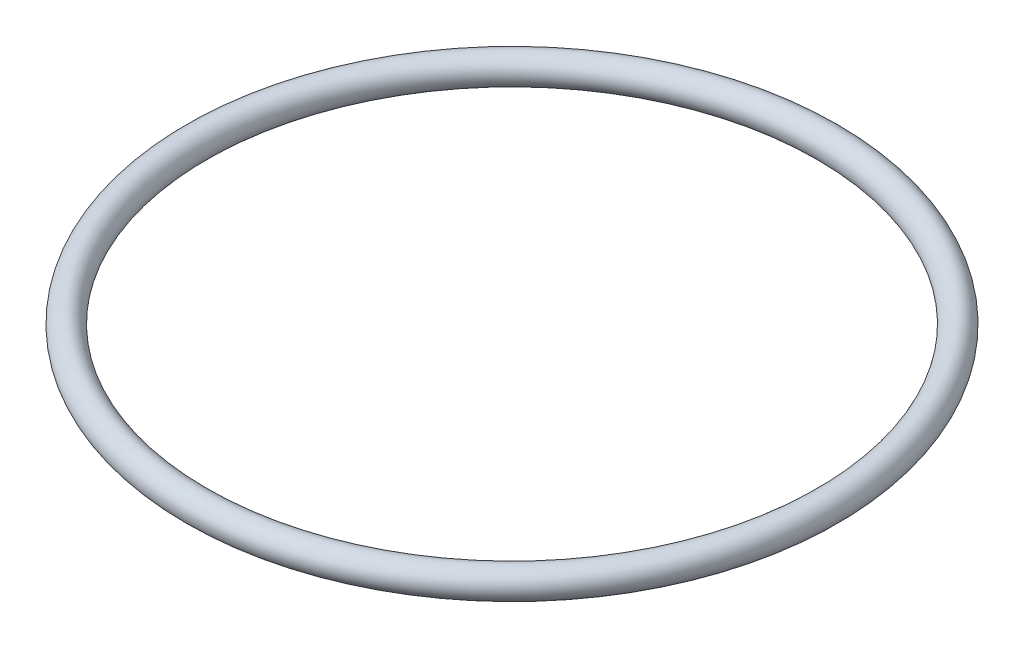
from build123d import *

# Parameters (mm, degrees)
ESQUISSE1_R = 1


with BuildPart() as part:
    # Esquisse1 → R_volution1 (revolve)
    with BuildSketch(Plane.XY, mode=Mode.PRIVATE) as r_volution1_sk:
        with Locations((22, 1.25)):
            Circle(ESQUISSE1_R)
    revolve(r_volution1_sk.sketch.rotate(Axis((0, 0, 0), (0, 1, 0)), 90), axis=Axis((0, 0, 0), (0, 1, 0)))


solid = part.part
